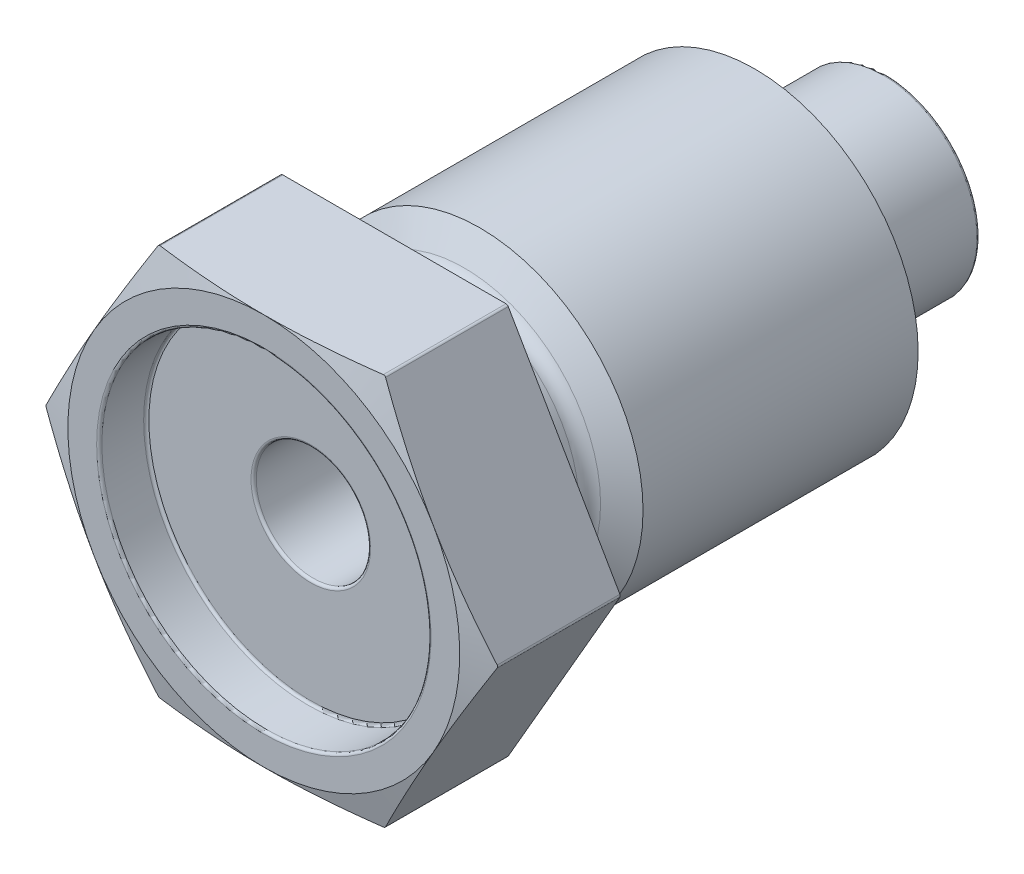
ISO-10303-21;
HEADER;
FILE_DESCRIPTION(('STEP AP214'),'2;1');
FILE_NAME('part.step','',(''),(''),'','','');
FILE_SCHEMA(('AUTOMOTIVE_DESIGN { 1 0 10303 214 1 1 1 1 }'));
ENDSEC;
DATA;
#1=APPLICATION_CONTEXT('core data for automotive mechanical design processes');
#2=APPLICATION_PROTOCOL_DEFINITION('international standard','automotive_design',2000,#1);
#3=PRODUCT_CONTEXT('',#1,'mechanical');
#4=PRODUCT('Part','Part','',(#3));
#5=PRODUCT_RELATED_PRODUCT_CATEGORY('part','',(#4));
#6=PRODUCT_DEFINITION_FORMATION('','',#4);
#7=PRODUCT_DEFINITION_CONTEXT('part definition',#1,'design');
#8=PRODUCT_DEFINITION('design','',#6,#7);
#9=PRODUCT_DEFINITION_SHAPE('','',#8);
#10=(LENGTH_UNIT() NAMED_UNIT(*) SI_UNIT(.MILLI.,.METRE.));
#11=(NAMED_UNIT(*) PLANE_ANGLE_UNIT() SI_UNIT($,.RADIAN.));
#12=(NAMED_UNIT(*) SI_UNIT($,.STERADIAN.) SOLID_ANGLE_UNIT());
#13=UNCERTAINTY_MEASURE_WITH_UNIT(LENGTH_MEASURE(1.E-05),#10,'distance_accuracy_value','');
#14=(GEOMETRIC_REPRESENTATION_CONTEXT(3) GLOBAL_UNCERTAINTY_ASSIGNED_CONTEXT((#13)) GLOBAL_UNIT_ASSIGNED_CONTEXT((#10,
#11,#12)) REPRESENTATION_CONTEXT('',''));
#15=CARTESIAN_POINT('',(0.,0.,0.));
#16=DIRECTION('',(0.,0.,1.));
#17=DIRECTION('',(1.,0.,0.));
#18=AXIS2_PLACEMENT_3D('',#15,#16,#17);
#19=CARTESIAN_POINT('',(0.,0.,-30.226));
#20=DIRECTION('',(0.,0.,1.));
#21=DIRECTION('',(1.,0.,0.));
#22=AXIS2_PLACEMENT_3D('',#19,#20,#21);
#23=CYLINDRICAL_SURFACE('',#22,2.7813);
#24=CARTESIAN_POINT('',(0.,0.,-30.099));
#25=DIRECTION('',(0.,0.,-1.));
#26=DIRECTION('',(-1.,0.,0.));
#27=AXIS2_PLACEMENT_3D('',#24,#25,#26);
#28=CIRCLE('',#27,2.7813);
#29=CARTESIAN_POINT('',(-2.7813,0.,-30.099));
#30=VERTEX_POINT('',#29);
#31=EDGE_CURVE('E380',#30,#30,#28,.T.);
#32=ORIENTED_EDGE('',*,*,#31,.T.);
#33=EDGE_LOOP('',(#32));
#34=FACE_BOUND('',#33,.T.);
#35=CARTESIAN_POINT('',(0.,0.,-2.413));
#36=DIRECTION('',(0.,0.,1.));
#37=DIRECTION('',(1.,0.,0.));
#38=AXIS2_PLACEMENT_3D('',#35,#36,#37);
#39=CIRCLE('',#38,2.7813);
#40=CARTESIAN_POINT('',(2.7813,0.,-2.413));
#41=VERTEX_POINT('',#40);
#42=EDGE_CURVE('E382',#41,#41,#39,.T.);
#43=ORIENTED_EDGE('',*,*,#42,.T.);
#44=EDGE_LOOP('',(#43));
#45=FACE_BOUND('',#44,.T.);
#46=ADVANCED_FACE('F31',(#34,#45),#23,.F.);
#47=CARTESIAN_POINT('',(10.9985226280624,0.,-6.35));
#48=DIRECTION('',(0.866025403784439,0.5,0.));
#49=DIRECTION('',(-0.5,0.866025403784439,0.));
#50=AXIS2_PLACEMENT_3D('',#47,#48,#49);
#51=PLANE('',#50);
#52=CARTESIAN_POINT('',(5.49914584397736,9.5252,-0.394860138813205));
#53=CARTESIAN_POINT('',(5.7275259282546,9.12963409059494,-0.333640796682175));
#54=CARTESIAN_POINT('',(5.95632008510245,8.73335098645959,-0.27806378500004));
#55=CARTESIAN_POINT('',(6.41471638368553,7.93938530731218,-0.180420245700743));
#56=CARTESIAN_POINT('',(6.64431881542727,7.54170222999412,-0.138359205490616));
#57=CARTESIAN_POINT('',(7.10293961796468,6.74734769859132,-0.0702030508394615));
#58=CARTESIAN_POINT('',(7.33195488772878,6.3506816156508,-0.0440266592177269));
#59=CARTESIAN_POINT('',(7.79027747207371,5.5568436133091,-0.00892680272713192));
#60=CARTESIAN_POINT('',(8.01958472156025,5.15967180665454,0.));
#61=CARTESIAN_POINT('',(8.47819922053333,4.36532819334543,0.));
#62=CARTESIAN_POINT('',(8.70750647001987,3.96815638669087,-0.0089268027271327));
#63=CARTESIAN_POINT('',(9.1658290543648,3.17431838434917,-0.0440266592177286));
#64=CARTESIAN_POINT('',(9.39484432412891,2.77765230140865,-0.0702030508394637));
#65=CARTESIAN_POINT('',(9.85346512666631,1.98329777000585,-0.13835920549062));
#66=CARTESIAN_POINT('',(10.0830675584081,1.58561469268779,-0.180420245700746));
#67=CARTESIAN_POINT('',(10.5414638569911,0.79164901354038,-0.278063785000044));
#68=CARTESIAN_POINT('',(10.770258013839,0.395365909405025,-0.33364079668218));
#69=CARTESIAN_POINT('',(10.9986380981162,-0.000200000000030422,-0.39486013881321));
#70=B_SPLINE_CURVE_WITH_KNOTS('',3,(#52,#53,#54,#55,#56,#57,#58,#59,#60,#61,#62,#63,#64,#65,#66,
#67,#68,#69),.UNSPECIFIED.,.F.,.F.,(4,2,2,2,2,2,2,2,4),(0.,1.38260595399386,2.76577253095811,
4.14180081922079,5.51756281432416,6.89332480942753,8.26935309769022,9.65251967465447,
11.0351256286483),.UNSPECIFIED.);
#71=CARTESIAN_POINT('',(8.24889197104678,4.7625,0.));
#72=VERTEX_POINT('',#71);
#73=CARTESIAN_POINT('',(10.9618608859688,0.0634999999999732,-0.385054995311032));
#74=VERTEX_POINT('',#73);
#75=EDGE_CURVE('E145',#72,#74,#70,.T.);
#76=ORIENTED_EDGE('',*,*,#75,.T.);
#77=DIRECTION('',(0.,0.,1.));
#78=VECTOR('',#77,1.);
#79=CARTESIAN_POINT('',(10.9618608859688,0.0634999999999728,-6.35));
#80=LINE('',#79,#78);
#81=CARTESIAN_POINT('',(10.9618608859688,0.0634999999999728,-6.35));
#82=VERTEX_POINT('',#81);
#83=EDGE_CURVE('E323',#74,#82,#80,.F.);
#84=ORIENTED_EDGE('',*,*,#83,.T.);
#85=DIRECTION('',(-0.5,0.866025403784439,0.));
#86=VECTOR('',#85,1.);
#87=CARTESIAN_POINT('',(10.9985226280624,0.,-6.35));
#88=LINE('',#87,#86);
#89=CARTESIAN_POINT('',(5.53592305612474,9.4615,-6.35));
#90=VERTEX_POINT('',#89);
#91=EDGE_CURVE('E483',#82,#90,#88,.T.);
#92=ORIENTED_EDGE('',*,*,#91,.T.);
#93=DIRECTION('',(0.,0.,1.));
#94=VECTOR('',#93,1.);
#95=CARTESIAN_POINT('',(5.53592305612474,9.4615,-6.35));
#96=LINE('',#95,#94);
#97=CARTESIAN_POINT('',(5.53592305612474,9.4615,-0.385054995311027));
#98=VERTEX_POINT('',#97);
#99=EDGE_CURVE('E149',#90,#98,#96,.T.);
#100=ORIENTED_EDGE('',*,*,#99,.T.);
#101=EDGE_CURVE('E141',#98,#72,#70,.T.);
#102=ORIENTED_EDGE('',*,*,#101,.T.);
#103=EDGE_LOOP('',(#76,#84,#92,#100,#102));
#104=FACE_BOUND('',#103,.T.);
#105=ADVANCED_FACE('F143',(#104),#51,.T.);
#106=CARTESIAN_POINT('',(5.4992613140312,9.525,-6.35));
#107=DIRECTION('',(0.,1.,0.));
#108=DIRECTION('',(0.,0.,1.));
#109=AXIS2_PLACEMENT_3D('',#106,#107,#108);
#110=PLANE('',#109);
#111=DIRECTION('',(-1.,0.,0.));
#112=VECTOR('',#111,1.);
#113=CARTESIAN_POINT('',(5.4992613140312,9.525,-6.35));
#114=LINE('',#113,#112);
#115=CARTESIAN_POINT('',(5.42593782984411,9.525,-6.35));
#116=VERTEX_POINT('',#115);
#117=CARTESIAN_POINT('',(-5.4259378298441,9.525,-6.35));
#118=VERTEX_POINT('',#117);
#119=EDGE_CURVE('E466',#116,#118,#114,.T.);
#120=ORIENTED_EDGE('',*,*,#119,.T.);
#121=DIRECTION('',(0.,0.,1.));
#122=VECTOR('',#121,1.);
#123=CARTESIAN_POINT('',(-5.4259378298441,9.525,-6.35));
#124=LINE('',#123,#122);
#125=CARTESIAN_POINT('',(-5.4259378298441,9.525,-0.385054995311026));
#126=VERTEX_POINT('',#125);
#127=EDGE_CURVE('E327',#118,#126,#124,.T.);
#128=ORIENTED_EDGE('',*,*,#127,.T.);
#129=CARTESIAN_POINT('',(-14.6175685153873,9.525,-2.12270214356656));
#130=CARTESIAN_POINT('',(-14.1846363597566,9.525,-2.02553708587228));
#131=CARTESIAN_POINT('',(-13.751435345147,9.525,-1.92954871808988));
#132=CARTESIAN_POINT('',(-12.8843634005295,9.525,-1.7405606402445));
#133=CARTESIAN_POINT('',(-12.450492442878,9.525,-1.64756105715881));
#134=CARTESIAN_POINT('',(-11.5815699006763,9.525,-1.46510699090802));
#135=CARTESIAN_POINT('',(-11.1465175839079,9.525,-1.37565598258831));
#136=CARTESIAN_POINT('',(-10.275512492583,9.525,-1.20125338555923));
#137=CARTESIAN_POINT('',(-9.83955972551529,9.525,-1.11630175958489));
#138=CARTESIAN_POINT('',(-8.9700820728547,9.525,-0.952627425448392));
#139=CARTESIAN_POINT('',(-8.53656556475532,9.525,-0.873860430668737));
#140=CARTESIAN_POINT('',(-7.66834295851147,9.525,-0.723124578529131));
#141=CARTESIAN_POINT('',(-7.23363685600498,9.525,-0.651155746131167));
#142=CARTESIAN_POINT('',(-6.36295854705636,9.525,-0.515624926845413));
#143=CARTESIAN_POINT('',(-5.92698649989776,9.525,-0.452061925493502));
#144=CARTESIAN_POINT('',(-5.05365285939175,9.525,-0.335202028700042));
#145=CARTESIAN_POINT('',(-4.61629126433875,9.525,-0.281905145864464));
#146=CARTESIAN_POINT('',(-3.73521331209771,9.525,-0.187071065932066));
#147=CARTESIAN_POINT('',(-3.29148149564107,9.525,-0.145675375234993));
#148=CARTESIAN_POINT('',(-2.40288728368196,9.525,-0.0774902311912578));
#149=CARTESIAN_POINT('',(-1.95802491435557,9.525,-0.0507004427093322));
#150=CARTESIAN_POINT('',(-1.06781744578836,9.525,-0.0132887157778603));
#151=CARTESIAN_POINT('',(-0.622472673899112,9.525,-0.00265914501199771));
#152=CARTESIAN_POINT('',(0.268301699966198,9.525,0.00177704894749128));
#153=CARTESIAN_POINT('',(0.713731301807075,9.525,-0.00441630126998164));
#154=CARTESIAN_POINT('',(1.60568726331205,9.525,-0.0332787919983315));
#155=CARTESIAN_POINT('',(2.05221162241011,9.525,-0.0560085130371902));
#156=CARTESIAN_POINT('',(2.94421955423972,9.525,-0.116640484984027));
#157=CARTESIAN_POINT('',(3.38970310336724,9.525,-0.154543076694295));
#158=CARTESIAN_POINT('',(4.27962466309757,9.525,-0.24358892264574));
#159=CARTESIAN_POINT('',(4.72406177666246,9.525,-0.294741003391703));
#160=CARTESIAN_POINT('',(5.61150281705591,9.525,-0.408135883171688));
#161=CARTESIAN_POINT('',(6.05450673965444,9.525,-0.470378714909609));
#162=CARTESIAN_POINT('',(6.91805602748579,9.525,-0.600761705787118));
#163=CARTESIAN_POINT('',(7.33866579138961,9.525,-0.668479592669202));
#164=CARTESIAN_POINT('',(8.17875258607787,9.525,-0.810642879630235));
#165=CARTESIAN_POINT('',(8.59822958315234,9.525,-0.885088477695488));
#166=CARTESIAN_POINT('',(9.4362168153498,9.525,-1.03945506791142));
#167=CARTESIAN_POINT('',(9.85472694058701,9.525,-1.11937665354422));
#168=CARTESIAN_POINT('',(10.6908659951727,9.525,-1.28366613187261));
#169=CARTESIAN_POINT('',(11.1084949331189,9.525,-1.36803398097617));
#170=CARTESIAN_POINT('',(11.9431118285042,9.525,-1.54042032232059));
#171=CARTESIAN_POINT('',(12.3600995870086,9.525,-1.62843977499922));
#172=CARTESIAN_POINT('',(13.1934351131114,9.525,-1.80746223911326));
#173=CARTESIAN_POINT('',(13.6097828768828,9.525,-1.89846526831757));
#174=CARTESIAN_POINT('',(14.8579523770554,9.525,-2.17512998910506));
#175=CARTESIAN_POINT('',(15.6889606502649,9.525,-2.3644599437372));
#176=CARTESIAN_POINT('',(17.3410597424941,9.525,-2.74796782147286));
#177=CARTESIAN_POINT('',(18.1621663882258,9.525,-2.94207801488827));
#178=CARTESIAN_POINT('',(19.803244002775,9.525,-3.33510260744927));
#179=CARTESIAN_POINT('',(20.623214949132,9.525,-3.53401710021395));
#180=CARTESIAN_POINT('',(22.2612251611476,9.525,-3.93512967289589));
#181=CARTESIAN_POINT('',(23.0792655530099,9.525,-4.13732316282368));
#182=CARTESIAN_POINT('',(24.3058113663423,9.525,-4.44261963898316));
#183=CARTESIAN_POINT('',(24.7145673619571,9.525,-4.54471778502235));
#184=CARTESIAN_POINT('',(25.5319306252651,9.525,-4.74950593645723));
#185=CARTESIAN_POINT('',(25.9405378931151,9.525,-4.8521959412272));
#186=CARTESIAN_POINT('',(26.3490803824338,9.525,-4.95514299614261));
#187=B_SPLINE_CURVE_WITH_KNOTS('',3,(#129,#130,#131,#132,#133,#134,#135,#136,#137,#138,#139,
#140,#141,#142,#143,#144,#145,#146,#147,#148,#149,#150,#151,#152,#153,#154,#155,#156,#157,#158,
#159,#160,#161,#162,#163,#164,#165,#166,#167,#168,#169,#170,#171,#172,#173,#174,#175,#176,#177,
#178,#179,#180,#181,#182,#183,#184,#185,#186),.UNSPECIFIED.,.F.,.F.,(4,2,2,2,2,2,2,2,2,2,2,2,2,
2,2,2,2,2,2,2,2,2,2,2,2,2,2,2,4),(0.,1.33111077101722,2.66227801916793,3.99471812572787,
5.32714719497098,6.64894632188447,7.97075030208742,9.29239461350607,10.6140405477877,
11.950806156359,13.2875410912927,14.6236445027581,15.9597458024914,17.3007666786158,
18.641817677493,19.9837643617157,21.325715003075,22.6037284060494,23.8817794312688,
25.1599691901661,26.4381464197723,27.716661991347,28.9951851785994,31.5520466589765,
34.0832457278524,36.6144941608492,39.1424618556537,40.406403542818,41.6703438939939),.UNSPECIFIED.);
#188=CARTESIAN_POINT('',(0.,9.525,0.));
#189=VERTEX_POINT('',#188);
#190=EDGE_CURVE('E215',#126,#189,#187,.T.);
#191=ORIENTED_EDGE('',*,*,#190,.T.);
#192=CARTESIAN_POINT('',(5.42593782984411,9.525,-0.385054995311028));
#193=VERTEX_POINT('',#192);
#194=EDGE_CURVE('E155',#189,#193,#187,.T.);
#195=ORIENTED_EDGE('',*,*,#194,.T.);
#196=DIRECTION('',(0.,0.,1.));
#197=VECTOR('',#196,1.);
#198=CARTESIAN_POINT('',(5.42593782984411,9.525,-6.35));
#199=LINE('',#198,#197);
#200=EDGE_CURVE('E325',#193,#116,#199,.F.);
#201=ORIENTED_EDGE('',*,*,#200,.T.);
#202=EDGE_LOOP('',(#120,#128,#191,#195,#201));
#203=FACE_BOUND('',#202,.T.);
#204=ADVANCED_FACE('F221',(#203),#110,.T.);
#205=CARTESIAN_POINT('',(-5.49926131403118,9.525,-6.35));
#206=DIRECTION('',(-0.866025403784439,0.5,0.));
#207=DIRECTION('',(-0.5,-0.866025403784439,0.));
#208=AXIS2_PLACEMENT_3D('',#205,#206,#207);
#209=PLANE('',#208);
#210=DIRECTION('',(-0.5,-0.866025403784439,0.));
#211=VECTOR('',#210,1.);
#212=CARTESIAN_POINT('',(-5.49926131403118,9.525,-6.35));
#213=LINE('',#212,#211);
#214=CARTESIAN_POINT('',(-5.53592305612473,9.4615,-6.35));
#215=VERTEX_POINT('',#214);
#216=CARTESIAN_POINT('',(-10.9618608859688,0.0635000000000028,-6.35));
#217=VERTEX_POINT('',#216);
#218=EDGE_CURVE('E426',#215,#217,#213,.T.);
#219=ORIENTED_EDGE('',*,*,#218,.T.);
#220=DIRECTION('',(0.,0.,1.));
#221=VECTOR('',#220,1.);
#222=CARTESIAN_POINT('',(-10.9618608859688,0.0635000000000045,-6.35));
#223=LINE('',#222,#221);
#224=CARTESIAN_POINT('',(-10.9618608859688,0.0635000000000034,-0.385054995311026));
#225=VERTEX_POINT('',#224);
#226=EDGE_CURVE('E268',#217,#225,#223,.T.);
#227=ORIENTED_EDGE('',*,*,#226,.T.);
#228=CARTESIAN_POINT('',(-10.9986380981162,-0.000199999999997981,-0.394860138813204));
#229=CARTESIAN_POINT('',(-10.770258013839,0.395365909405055,-0.333640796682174));
#230=CARTESIAN_POINT('',(-10.5414638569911,0.791649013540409,-0.278063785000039));
#231=CARTESIAN_POINT('',(-10.083067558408,1.58561469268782,-0.180420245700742));
#232=CARTESIAN_POINT('',(-9.8534651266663,1.98329777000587,-0.138359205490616));
#233=CARTESIAN_POINT('',(-9.39484432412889,2.77765230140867,-0.0702030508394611));
#234=CARTESIAN_POINT('',(-9.16582905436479,3.17431838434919,-0.0440266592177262));
#235=CARTESIAN_POINT('',(-8.70750647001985,3.96815638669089,-0.00892680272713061));
#236=CARTESIAN_POINT('',(-8.47819922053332,4.36532819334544,0.));
#237=CARTESIAN_POINT('',(-8.01958472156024,5.15967180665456,0.));
#238=CARTESIAN_POINT('',(-7.7902774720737,5.55684361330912,-0.00892680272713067));
#239=CARTESIAN_POINT('',(-7.33195488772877,6.35068161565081,-0.044026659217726));
#240=CARTESIAN_POINT('',(-7.10293961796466,6.74734769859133,-0.0702030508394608));
#241=CARTESIAN_POINT('',(-6.64431881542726,7.54170222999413,-0.138359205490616));
#242=CARTESIAN_POINT('',(-6.41471638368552,7.93938530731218,-0.180420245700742));
#243=CARTESIAN_POINT('',(-5.95632008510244,8.73335098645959,-0.278063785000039));
#244=CARTESIAN_POINT('',(-5.72752592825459,9.12963409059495,-0.333640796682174));
#245=CARTESIAN_POINT('',(-5.49914584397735,9.5252,-0.394860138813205));
#246=B_SPLINE_CURVE_WITH_KNOTS('',3,(#228,#229,#230,#231,#232,#233,#234,#235,#236,#237,#238,
#239,#240,#241,#242,#243,#244,#245),.UNSPECIFIED.,.F.,.F.,(4,2,2,2,2,2,2,2,4),(0.,
1.38260595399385,2.7657725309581,4.14180081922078,5.51756281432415,6.89332480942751,
8.26935309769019,9.65251967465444,11.0351256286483),.UNSPECIFIED.);
#247=CARTESIAN_POINT('',(-8.24889197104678,4.7625,0.));
#248=VERTEX_POINT('',#247);
#249=EDGE_CURVE('E424',#225,#248,#246,.T.);
#250=ORIENTED_EDGE('',*,*,#249,.T.);
#251=CARTESIAN_POINT('',(-5.53592305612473,9.4615,-0.385054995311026));
#252=VERTEX_POINT('',#251);
#253=EDGE_CURVE('E216',#248,#252,#246,.T.);
#254=ORIENTED_EDGE('',*,*,#253,.T.);
#255=DIRECTION('',(0.,0.,1.));
#256=VECTOR('',#255,1.);
#257=CARTESIAN_POINT('',(-5.53592305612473,9.4615,-6.35));
#258=LINE('',#257,#256);
#259=EDGE_CURVE('E416',#252,#215,#258,.F.);
#260=ORIENTED_EDGE('',*,*,#259,.T.);
#261=EDGE_LOOP('',(#219,#227,#250,#254,#260));
#262=FACE_BOUND('',#261,.T.);
#263=ADVANCED_FACE('F201',(#262),#209,.T.);
#264=CARTESIAN_POINT('',(-10.9985226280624,0.,-6.35));
#265=DIRECTION('',(-0.866025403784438,-0.500000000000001,0.));
#266=DIRECTION('',(0.500000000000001,-0.866025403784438,0.));
#267=AXIS2_PLACEMENT_3D('',#264,#265,#266);
#268=PLANE('',#267);
#269=CARTESIAN_POINT('',(-5.49914584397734,-9.5252,-0.394860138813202));
#270=CARTESIAN_POINT('',(-5.72752592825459,-9.12963409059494,-0.333640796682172));
#271=CARTESIAN_POINT('',(-5.95632008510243,-8.73335098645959,-0.278063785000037));
#272=CARTESIAN_POINT('',(-6.41471638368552,-7.93938530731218,-0.18042024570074));
#273=CARTESIAN_POINT('',(-6.64431881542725,-7.54170222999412,-0.138359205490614));
#274=CARTESIAN_POINT('',(-7.10293961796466,-6.74734769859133,-0.070203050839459));
#275=CARTESIAN_POINT('',(-7.33195488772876,-6.3506816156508,-0.0440266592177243));
#276=CARTESIAN_POINT('',(-7.79027747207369,-5.55684361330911,-0.00892680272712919));
#277=CARTESIAN_POINT('',(-8.01958472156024,-5.15967180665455,0.));
#278=CARTESIAN_POINT('',(-8.47819922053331,-4.36532819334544,0.));
#279=CARTESIAN_POINT('',(-8.70750647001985,-3.96815638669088,-0.00892680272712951));
#280=CARTESIAN_POINT('',(-9.16582905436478,-3.17431838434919,-0.044026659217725));
#281=CARTESIAN_POINT('',(-9.39484432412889,-2.77765230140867,-0.07020305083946));
#282=CARTESIAN_POINT('',(-9.85346512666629,-1.98329777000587,-0.138359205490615));
#283=CARTESIAN_POINT('',(-10.083067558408,-1.58561469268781,-0.180420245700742));
#284=CARTESIAN_POINT('',(-10.5414638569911,-0.791649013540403,-0.278063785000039));
#285=CARTESIAN_POINT('',(-10.770258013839,-0.39536590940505,-0.333640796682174));
#286=CARTESIAN_POINT('',(-10.9986380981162,0.000200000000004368,-0.394860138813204));
#287=B_SPLINE_CURVE_WITH_KNOTS('',3,(#269,#270,#271,#272,#273,#274,#275,#276,#277,#278,#279,
#280,#281,#282,#283,#284,#285,#286),.UNSPECIFIED.,.F.,.F.,(4,2,2,2,2,2,2,2,4),(0.,
1.38260595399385,2.7657725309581,4.14180081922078,5.51756281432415,6.89332480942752,
8.2693530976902,9.65251967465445,11.0351256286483),.UNSPECIFIED.);
#288=CARTESIAN_POINT('',(-8.24889197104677,-4.7625,0.));
#289=VERTEX_POINT('',#288);
#290=CARTESIAN_POINT('',(-10.9618608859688,-0.063499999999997,-0.385054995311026));
#291=VERTEX_POINT('',#290);
#292=EDGE_CURVE('E210',#289,#291,#287,.T.);
#293=ORIENTED_EDGE('',*,*,#292,.T.);
#294=DIRECTION('',(0.,0.,1.));
#295=VECTOR('',#294,1.);
#296=CARTESIAN_POINT('',(-10.9618608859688,-0.0634999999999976,-6.35));
#297=LINE('',#296,#295);
#298=CARTESIAN_POINT('',(-10.9618608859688,-0.0634999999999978,-6.35));
#299=VERTEX_POINT('',#298);
#300=EDGE_CURVE('E272',#291,#299,#297,.F.);
#301=ORIENTED_EDGE('',*,*,#300,.T.);
#302=DIRECTION('',(0.500000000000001,-0.866025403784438,0.));
#303=VECTOR('',#302,1.);
#304=CARTESIAN_POINT('',(-10.9985226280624,0.,-6.35));
#305=LINE('',#304,#303);
#306=CARTESIAN_POINT('',(-5.53592305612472,-9.4615,-6.35));
#307=VERTEX_POINT('',#306);
#308=EDGE_CURVE('E461',#299,#307,#305,.T.);
#309=ORIENTED_EDGE('',*,*,#308,.T.);
#310=DIRECTION('',(0.,0.,1.));
#311=VECTOR('',#310,1.);
#312=CARTESIAN_POINT('',(-5.53592305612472,-9.4615,-6.35));
#313=LINE('',#312,#311);
#314=CARTESIAN_POINT('',(-5.53592305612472,-9.4615,-0.385054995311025));
#315=VERTEX_POINT('',#314);
#316=EDGE_CURVE('E267',#307,#315,#313,.T.);
#317=ORIENTED_EDGE('',*,*,#316,.T.);
#318=EDGE_CURVE('E205',#315,#289,#287,.T.);
#319=ORIENTED_EDGE('',*,*,#318,.T.);
#320=EDGE_LOOP('',(#293,#301,#309,#317,#319));
#321=FACE_BOUND('',#320,.T.);
#322=ADVANCED_FACE('F194',(#321),#268,.T.);
#323=CARTESIAN_POINT('',(-5.49926131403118,-9.525,-6.35));
#324=DIRECTION('',(0.,-1.,0.));
#325=DIRECTION('',(0.,0.,-1.));
#326=AXIS2_PLACEMENT_3D('',#323,#324,#325);
#327=PLANE('',#326);
#328=CARTESIAN_POINT('',(-14.6175685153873,-9.525,-2.12270214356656));
#329=CARTESIAN_POINT('',(-14.1846363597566,-9.525,-2.02553708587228));
#330=CARTESIAN_POINT('',(-13.751435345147,-9.525,-1.92954871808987));
#331=CARTESIAN_POINT('',(-12.8843634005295,-9.525,-1.74056064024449));
#332=CARTESIAN_POINT('',(-12.450492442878,-9.525,-1.64756105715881));
#333=CARTESIAN_POINT('',(-11.5815699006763,-9.525,-1.46510699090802));
#334=CARTESIAN_POINT('',(-11.1465175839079,-9.525,-1.37565598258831));
#335=CARTESIAN_POINT('',(-10.275512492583,-9.525,-1.20125338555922));
#336=CARTESIAN_POINT('',(-9.83955972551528,-9.525,-1.11630175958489));
#337=CARTESIAN_POINT('',(-8.97008207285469,-9.525,-0.952627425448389));
#338=CARTESIAN_POINT('',(-8.53656556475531,-9.525,-0.873860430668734));
#339=CARTESIAN_POINT('',(-7.66834295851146,-9.525,-0.723124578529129));
#340=CARTESIAN_POINT('',(-7.23363685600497,-9.525,-0.651155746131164));
#341=CARTESIAN_POINT('',(-6.36295854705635,-9.525,-0.515624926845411));
#342=CARTESIAN_POINT('',(-5.92698649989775,-9.525,-0.4520619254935));
#343=CARTESIAN_POINT('',(-5.05365285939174,-9.525,-0.33520202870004));
#344=CARTESIAN_POINT('',(-4.61629126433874,-9.525,-0.281905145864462));
#345=CARTESIAN_POINT('',(-3.7352133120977,-9.525,-0.187071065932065));
#346=CARTESIAN_POINT('',(-3.29148149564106,-9.525,-0.145675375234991));
#347=CARTESIAN_POINT('',(-2.40288728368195,-9.525,-0.0774902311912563));
#348=CARTESIAN_POINT('',(-1.95802491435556,-9.525,-0.0507004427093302));
#349=CARTESIAN_POINT('',(-1.06781744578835,-9.525,-0.0132887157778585));
#350=CARTESIAN_POINT('',(-0.622472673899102,-9.525,-0.00265914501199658));
#351=CARTESIAN_POINT('',(0.268301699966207,-9.525,0.001777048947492));
#352=CARTESIAN_POINT('',(0.713731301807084,-9.525,-0.0044163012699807));
#353=CARTESIAN_POINT('',(1.60568726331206,-9.525,-0.0332787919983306));
#354=CARTESIAN_POINT('',(2.05221162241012,-9.525,-0.0560085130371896));
#355=CARTESIAN_POINT('',(2.94421955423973,-9.525,-0.116640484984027));
#356=CARTESIAN_POINT('',(3.38970310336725,-9.525,-0.154543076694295));
#357=CARTESIAN_POINT('',(4.27962466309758,-9.525,-0.24358892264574));
#358=CARTESIAN_POINT('',(4.72406177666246,-9.525,-0.294741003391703));
#359=CARTESIAN_POINT('',(5.61150281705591,-9.525,-0.408135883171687));
#360=CARTESIAN_POINT('',(6.05450673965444,-9.525,-0.470378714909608));
#361=CARTESIAN_POINT('',(6.91805602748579,-9.525,-0.600761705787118));
#362=CARTESIAN_POINT('',(7.33866579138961,-9.525,-0.668479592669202));
#363=CARTESIAN_POINT('',(8.17875258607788,-9.525,-0.810642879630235));
#364=CARTESIAN_POINT('',(8.59822958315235,-9.525,-0.885088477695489));
#365=CARTESIAN_POINT('',(9.4362168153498,-9.525,-1.03945506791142));
#366=CARTESIAN_POINT('',(9.85472694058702,-9.525,-1.11937665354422));
#367=CARTESIAN_POINT('',(10.6908659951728,-9.525,-1.28366613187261));
#368=CARTESIAN_POINT('',(11.1084949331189,-9.525,-1.36803398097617));
#369=CARTESIAN_POINT('',(11.9431118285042,-9.525,-1.54042032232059));
#370=CARTESIAN_POINT('',(12.3600995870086,-9.525,-1.62843977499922));
#371=CARTESIAN_POINT('',(13.1934351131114,-9.525,-1.80746223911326));
#372=CARTESIAN_POINT('',(13.6097828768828,-9.525,-1.89846526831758));
#373=CARTESIAN_POINT('',(14.8579523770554,-9.525,-2.17512998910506));
#374=CARTESIAN_POINT('',(15.6889606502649,-9.525,-2.3644599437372));
#375=CARTESIAN_POINT('',(17.3410597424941,-9.525,-2.74796782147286));
#376=CARTESIAN_POINT('',(18.1621663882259,-9.525,-2.94207801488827));
#377=CARTESIAN_POINT('',(19.8032440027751,-9.525,-3.33510260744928));
#378=CARTESIAN_POINT('',(20.623214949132,-9.525,-3.53401710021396));
#379=CARTESIAN_POINT('',(22.2612251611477,-9.525,-3.93512967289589));
#380=CARTESIAN_POINT('',(23.0792655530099,-9.525,-4.13732316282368));
#381=CARTESIAN_POINT('',(24.3058113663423,-9.525,-4.44261963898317));
#382=CARTESIAN_POINT('',(24.7145673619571,-9.525,-4.54471778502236));
#383=CARTESIAN_POINT('',(25.5319306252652,-9.525,-4.74950593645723));
#384=CARTESIAN_POINT('',(25.9405378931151,-9.525,-4.85219594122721));
#385=CARTESIAN_POINT('',(26.3490803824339,-9.525,-4.95514299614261));
#386=B_SPLINE_CURVE_WITH_KNOTS('',3,(#328,#329,#330,#331,#332,#333,#334,#335,#336,#337,#338,
#339,#340,#341,#342,#343,#344,#345,#346,#347,#348,#349,#350,#351,#352,#353,#354,#355,#356,#357,
#358,#359,#360,#361,#362,#363,#364,#365,#366,#367,#368,#369,#370,#371,#372,#373,#374,#375,#376,
#377,#378,#379,#380,#381,#382,#383,#384,#385),.UNSPECIFIED.,.F.,.F.,(4,2,2,2,2,2,2,2,2,2,2,2,2,
2,2,2,2,2,2,2,2,2,2,2,2,2,2,2,4),(0.,1.33111077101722,2.66227801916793,3.99471812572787,
5.32714719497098,6.64894632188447,7.97075030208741,9.29239461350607,10.6140405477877,
11.950806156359,13.2875410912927,14.6236445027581,15.9597458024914,17.3007666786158,
18.641817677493,19.9837643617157,21.325715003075,22.6037284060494,23.8817794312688,
25.1599691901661,26.4381464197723,27.716661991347,28.9951851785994,31.5520466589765,
34.0832457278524,36.6144941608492,39.1424618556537,40.406403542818,41.670343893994),.UNSPECIFIED.);
#387=CARTESIAN_POINT('',(0.,-9.525,0.));
#388=VERTEX_POINT('',#387);
#389=CARTESIAN_POINT('',(-5.4259378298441,-9.525,-0.385054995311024));
#390=VERTEX_POINT('',#389);
#391=EDGE_CURVE('E150',#388,#390,#386,.F.);
#392=ORIENTED_EDGE('',*,*,#391,.T.);
#393=DIRECTION('',(0.,0.,1.));
#394=VECTOR('',#393,1.);
#395=CARTESIAN_POINT('',(-5.42593782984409,-9.525,-6.35));
#396=LINE('',#395,#394);
#397=CARTESIAN_POINT('',(-5.42593782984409,-9.525,-6.35));
#398=VERTEX_POINT('',#397);
#399=EDGE_CURVE('E294',#390,#398,#396,.F.);
#400=ORIENTED_EDGE('',*,*,#399,.T.);
#401=DIRECTION('',(1.,0.,0.));
#402=VECTOR('',#401,1.);
#403=CARTESIAN_POINT('',(-5.49926131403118,-9.525,-6.35));
#404=LINE('',#403,#402);
#405=CARTESIAN_POINT('',(5.42593782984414,-9.525,-6.35));
#406=VERTEX_POINT('',#405);
#407=EDGE_CURVE('E462',#398,#406,#404,.T.);
#408=ORIENTED_EDGE('',*,*,#407,.T.);
#409=DIRECTION('',(0.,0.,1.));
#410=VECTOR('',#409,1.);
#411=CARTESIAN_POINT('',(5.42593782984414,-9.525,-6.35));
#412=LINE('',#411,#410);
#413=CARTESIAN_POINT('',(5.42593782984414,-9.525,-0.38505499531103));
#414=VERTEX_POINT('',#413);
#415=EDGE_CURVE('E291',#406,#414,#412,.T.);
#416=ORIENTED_EDGE('',*,*,#415,.T.);
#417=EDGE_CURVE('E159',#414,#388,#386,.F.);
#418=ORIENTED_EDGE('',*,*,#417,.T.);
#419=EDGE_LOOP('',(#392,#400,#408,#416,#418));
#420=FACE_BOUND('',#419,.T.);
#421=ADVANCED_FACE('F189',(#420),#327,.T.);
#422=CARTESIAN_POINT('',(5.49926131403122,-9.525,-6.35));
#423=DIRECTION('',(0.866025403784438,-0.5,0.));
#424=DIRECTION('',(0.5,0.866025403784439,0.));
#425=AXIS2_PLACEMENT_3D('',#422,#423,#424);
#426=PLANE('',#425);
#427=CARTESIAN_POINT('',(10.9986380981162,0.000199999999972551,-0.39486013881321));
#428=CARTESIAN_POINT('',(10.770258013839,-0.395365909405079,-0.333640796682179));
#429=CARTESIAN_POINT('',(10.5414638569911,-0.791649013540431,-0.278063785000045));
#430=CARTESIAN_POINT('',(10.0830675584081,-1.58561469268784,-0.180420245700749));
#431=CARTESIAN_POINT('',(9.85346512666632,-1.98329777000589,-0.138359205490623));
#432=CARTESIAN_POINT('',(9.39484432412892,-2.77765230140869,-0.0702030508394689));
#433=CARTESIAN_POINT('',(9.16582905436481,-3.17431838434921,-0.0440266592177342));
#434=CARTESIAN_POINT('',(8.70750647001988,-3.9681563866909,-0.00892680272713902));
#435=CARTESIAN_POINT('',(8.47819922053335,-4.36532819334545,0.));
#436=CARTESIAN_POINT('',(8.01958472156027,-5.15967180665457,0.));
#437=CARTESIAN_POINT('',(7.79027747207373,-5.55684361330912,-0.00892680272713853));
#438=CARTESIAN_POINT('',(7.3319548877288,-6.35068161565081,-0.0440266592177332));
#439=CARTESIAN_POINT('',(7.1029396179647,-6.74734769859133,-0.0702030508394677));
#440=CARTESIAN_POINT('',(6.64431881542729,-7.54170222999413,-0.138359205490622));
#441=CARTESIAN_POINT('',(6.41471638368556,-7.93938530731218,-0.180420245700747));
#442=CARTESIAN_POINT('',(5.95632008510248,-8.73335098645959,-0.278063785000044));
#443=CARTESIAN_POINT('',(5.72752592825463,-9.12963409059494,-0.333640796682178));
#444=CARTESIAN_POINT('',(5.49914584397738,-9.52519999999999,-0.394860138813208));
#445=B_SPLINE_CURVE_WITH_KNOTS('',3,(#427,#428,#429,#430,#431,#432,#433,#434,#435,#436,#437,
#438,#439,#440,#441,#442,#443,#444),.UNSPECIFIED.,.F.,.F.,(4,2,2,2,2,2,2,2,4),(0.,
1.38260595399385,2.76577253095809,4.14180081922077,5.51756281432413,6.89332480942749,
8.26935309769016,9.65251967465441,11.0351256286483),.UNSPECIFIED.);
#446=CARTESIAN_POINT('',(8.2488919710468,-4.76250000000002,0.));
#447=VERTEX_POINT('',#446);
#448=CARTESIAN_POINT('',(5.53592305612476,-9.46149999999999,-0.38505499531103));
#449=VERTEX_POINT('',#448);
#450=EDGE_CURVE('E464',#447,#449,#445,.T.);
#451=ORIENTED_EDGE('',*,*,#450,.T.);
#452=DIRECTION('',(0.,0.,1.));
#453=VECTOR('',#452,1.);
#454=CARTESIAN_POINT('',(5.53592305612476,-9.4615,-6.35));
#455=LINE('',#454,#453);
#456=CARTESIAN_POINT('',(5.53592305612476,-9.4615,-6.35));
#457=VERTEX_POINT('',#456);
#458=EDGE_CURVE('E321',#449,#457,#455,.F.);
#459=ORIENTED_EDGE('',*,*,#458,.T.);
#460=DIRECTION('',(0.5,0.866025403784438,0.));
#461=VECTOR('',#460,1.);
#462=CARTESIAN_POINT('',(5.49926131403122,-9.525,-6.35));
#463=LINE('',#462,#461);
#464=CARTESIAN_POINT('',(10.9618608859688,-0.0635000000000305,-6.35));
#465=VERTEX_POINT('',#464);
#466=EDGE_CURVE('E479',#457,#465,#463,.T.);
#467=ORIENTED_EDGE('',*,*,#466,.T.);
#468=DIRECTION('',(0.,0.,1.));
#469=VECTOR('',#468,1.);
#470=CARTESIAN_POINT('',(10.9618608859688,-0.0635000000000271,-6.35));
#471=LINE('',#470,#469);
#472=CARTESIAN_POINT('',(10.9618608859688,-0.063500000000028,-0.385054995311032));
#473=VERTEX_POINT('',#472);
#474=EDGE_CURVE('E301',#465,#473,#471,.T.);
#475=ORIENTED_EDGE('',*,*,#474,.T.);
#476=EDGE_CURVE('E411',#473,#447,#445,.T.);
#477=ORIENTED_EDGE('',*,*,#476,.T.);
#478=EDGE_LOOP('',(#451,#459,#467,#475,#477));
#479=FACE_BOUND('',#478,.T.);
#480=ADVANCED_FACE('F33',(#479),#426,.T.);
#481=CARTESIAN_POINT('',(0.,0.,-30.226));
#482=DIRECTION('',(0.,0.,1.));
#483=DIRECTION('',(1.,0.,0.));
#484=AXIS2_PLACEMENT_3D('',#481,#482,#483);
#485=CYLINDRICAL_SURFACE('',#484,7.9375);
#486=CARTESIAN_POINT('',(0.,0.,-23.876));
#487=DIRECTION('',(0.,0.,1.));
#488=DIRECTION('',(1.,0.,0.));
#489=AXIS2_PLACEMENT_3D('',#486,#487,#488);
#490=CIRCLE('',#489,7.9375);
#491=CARTESIAN_POINT('',(7.9375,0.,-23.876));
#492=VERTEX_POINT('',#491);
#493=EDGE_CURVE('E484',#492,#492,#490,.T.);
#494=ORIENTED_EDGE('',*,*,#493,.T.);
#495=EDGE_LOOP('',(#494));
#496=FACE_BOUND('',#495,.T.);
#497=CARTESIAN_POINT('',(0.,0.,-10.5009355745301));
#498=DIRECTION('',(0.,0.,1.));
#499=DIRECTION('',(1.,0.,0.));
#500=AXIS2_PLACEMENT_3D('',#497,#498,#499);
#501=CIRCLE('',#500,7.9375);
#502=CARTESIAN_POINT('',(7.9375,0.,-10.5009355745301));
#503=VERTEX_POINT('',#502);
#504=EDGE_CURVE('E435',#503,#503,#501,.T.);
#505=ORIENTED_EDGE('',*,*,#504,.F.);
#506=EDGE_LOOP('',(#505));
#507=FACE_BOUND('',#506,.T.);
#508=ADVANCED_FACE('F510',(#496,#507),#485,.T.);
#509=CARTESIAN_POINT('',(0.,7.9375,-23.876));
#510=DIRECTION('',(0.,0.,-1.));
#511=DIRECTION('',(-1.,0.,0.));
#512=AXIS2_PLACEMENT_3D('',#509,#510,#511);
#513=PLANE('',#512);
#514=CARTESIAN_POINT('',(0.,0.,-23.876));
#515=DIRECTION('',(0.,0.,-1.));
#516=DIRECTION('',(-1.,0.,0.));
#517=AXIS2_PLACEMENT_3D('',#514,#515,#516);
#518=CIRCLE('',#517,5.334);
#519=CARTESIAN_POINT('',(-5.334,0.,-23.876));
#520=VERTEX_POINT('',#519);
#521=EDGE_CURVE('E405',#520,#520,#518,.F.);
#522=ORIENTED_EDGE('',*,*,#521,.T.);
#523=EDGE_LOOP('',(#522));
#524=FACE_BOUND('',#523,.T.);
#525=ORIENTED_EDGE('',*,*,#493,.F.);
#526=EDGE_LOOP('',(#525));
#527=FACE_BOUND('',#526,.T.);
#528=ADVANCED_FACE('F399',(#524,#527),#513,.T.);
#529=CARTESIAN_POINT('',(0.,0.,1.16018937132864));
#530=DIRECTION('',(0.,0.,1.));
#531=DIRECTION('',(1.,0.,0.));
#532=AXIS2_PLACEMENT_3D('',#529,#530,#531);
#533=CYLINDRICAL_SURFACE('',#532,4.572);
#534=CARTESIAN_POINT('',(0.,0.,-30.099));
#535=DIRECTION('',(0.,0.,-1.));
#536=DIRECTION('',(-1.,0.,0.));
#537=AXIS2_PLACEMENT_3D('',#534,#535,#536);
#538=CIRCLE('',#537,4.572);
#539=CARTESIAN_POINT('',(-4.572,0.,-30.099));
#540=VERTEX_POINT('',#539);
#541=EDGE_CURVE('E337',#540,#540,#538,.F.);
#542=ORIENTED_EDGE('',*,*,#541,.T.);
#543=EDGE_LOOP('',(#542));
#544=FACE_BOUND('',#543,.T.);
#545=CARTESIAN_POINT('',(0.,0.,-24.638));
#546=DIRECTION('',(0.,0.,-1.));
#547=DIRECTION('',(-1.,0.,0.));
#548=AXIS2_PLACEMENT_3D('',#545,#546,#547);
#549=CIRCLE('',#548,4.572);
#550=CARTESIAN_POINT('',(-4.572,0.,-24.638));
#551=VERTEX_POINT('',#550);
#552=EDGE_CURVE('E403',#551,#551,#549,.T.);
#553=ORIENTED_EDGE('',*,*,#552,.T.);
#554=EDGE_LOOP('',(#553));
#555=FACE_BOUND('',#554,.T.);
#556=ADVANCED_FACE('F394',(#544,#555),#533,.T.);
#557=CARTESIAN_POINT('',(0.,0.,-30.226));
#558=DIRECTION('',(0.,0.,-1.));
#559=DIRECTION('',(-1.,0.,0.));
#560=AXIS2_PLACEMENT_3D('',#557,#558,#559);
#561=PLANE('',#560);
#562=CARTESIAN_POINT('',(0.,0.,-30.226));
#563=DIRECTION('',(0.,0.,-1.));
#564=DIRECTION('',(-1.,0.,0.));
#565=AXIS2_PLACEMENT_3D('',#562,#563,#564);
#566=CIRCLE('',#565,4.445);
#567=CARTESIAN_POINT('',(-4.445,0.,-30.226));
#568=VERTEX_POINT('',#567);
#569=EDGE_CURVE('E385',#568,#568,#566,.T.);
#570=ORIENTED_EDGE('',*,*,#569,.T.);
#571=EDGE_LOOP('',(#570));
#572=FACE_BOUND('',#571,.T.);
#573=CARTESIAN_POINT('',(0.,0.,-30.226));
#574=DIRECTION('',(0.,0.,-1.));
#575=DIRECTION('',(-1.,0.,0.));
#576=AXIS2_PLACEMENT_3D('',#573,#574,#575);
#577=CIRCLE('',#576,2.9083);
#578=CARTESIAN_POINT('',(-2.9083,0.,-30.226));
#579=VERTEX_POINT('',#578);
#580=EDGE_CURVE('E387',#579,#579,#577,.F.);
#581=ORIENTED_EDGE('',*,*,#580,.T.);
#582=EDGE_LOOP('',(#581));
#583=FACE_BOUND('',#582,.T.);
#584=ADVANCED_FACE('F398',(#572,#583),#561,.T.);
#585=CARTESIAN_POINT('',(0.,0.,1.16018937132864));
#586=DIRECTION('',(0.,0.,1.));
#587=DIRECTION('',(1.,0.,0.));
#588=AXIS2_PLACEMENT_3D('',#585,#586,#587);
#589=CYLINDRICAL_SURFACE('',#588,6.24713);
#590=CARTESIAN_POINT('',(0.,0.,-7.112));
#591=DIRECTION('',(0.,0.,-1.));
#592=DIRECTION('',(-1.,0.,0.));
#593=AXIS2_PLACEMENT_3D('',#590,#591,#592);
#594=CIRCLE('',#593,6.24713);
#595=CARTESIAN_POINT('',(-6.24713,0.,-7.112));
#596=VERTEX_POINT('',#595);
#597=EDGE_CURVE('E408',#596,#596,#594,.T.);
#598=ORIENTED_EDGE('',*,*,#597,.T.);
#599=EDGE_LOOP('',(#598));
#600=FACE_BOUND('',#599,.T.);
#601=CARTESIAN_POINT('',(0.,0.,-9.0850590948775));
#602=DIRECTION('',(0.,0.,1.));
#603=DIRECTION('',(1.,0.,0.));
#604=AXIS2_PLACEMENT_3D('',#601,#602,#603);
#605=CIRCLE('',#604,6.24713);
#606=CARTESIAN_POINT('',(6.24713,0.,-9.0850590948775));
#607=VERTEX_POINT('',#606);
#608=EDGE_CURVE('E535',#607,#607,#605,.T.);
#609=ORIENTED_EDGE('',*,*,#608,.T.);
#610=EDGE_LOOP('',(#609));
#611=FACE_BOUND('',#610,.T.);
#612=ADVANCED_FACE('F516',(#600,#611),#589,.T.);
#613=CARTESIAN_POINT('',(0.,0.,-9.0850590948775));
#614=DIRECTION('',(0.,0.,1.));
#615=DIRECTION('',(1.,0.,0.));
#616=AXIS2_PLACEMENT_3D('',#613,#614,#615);
#617=TOROIDAL_SURFACE('',#616,7.00913,0.762);
#618=CARTESIAN_POINT('',(0.,0.,-9.74497045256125));
#619=DIRECTION('',(0.,0.,1.));
#620=DIRECTION('',(1.,0.,0.));
#621=AXIS2_PLACEMENT_3D('',#618,#619,#620);
#622=CIRCLE('',#621,6.62813);
#623=CARTESIAN_POINT('',(6.62813,0.,-9.74497045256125));
#624=VERTEX_POINT('',#623);
#625=EDGE_CURVE('E437',#624,#624,#622,.T.);
#626=ORIENTED_EDGE('',*,*,#625,.T.);
#627=EDGE_LOOP('',(#626));
#628=FACE_BOUND('',#627,.T.);
#629=ORIENTED_EDGE('',*,*,#608,.F.);
#630=EDGE_LOOP('',(#629));
#631=FACE_BOUND('',#630,.T.);
#632=ADVANCED_FACE('F523',(#628,#631),#617,.F.);
#633=CARTESIAN_POINT('',(0.,0.,-9.74497045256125));
#634=DIRECTION('',(0.,0.,-1.));
#635=DIRECTION('',(-1.,0.,0.));
#636=AXIS2_PLACEMENT_3D('',#633,#634,#635);
#637=CONICAL_SURFACE('',#636,6.62813,1.0471975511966);
#638=ORIENTED_EDGE('',*,*,#504,.T.);
#639=EDGE_LOOP('',(#638));
#640=FACE_BOUND('',#639,.T.);
#641=ORIENTED_EDGE('',*,*,#625,.F.);
#642=EDGE_LOOP('',(#641));
#643=FACE_BOUND('',#642,.T.);
#644=ADVANCED_FACE('F493',(#640,#643),#637,.T.);
#645=CARTESIAN_POINT('',(0.,-19.05,-6.35));
#646=DIRECTION('',(0.,0.,-1.));
#647=DIRECTION('',(-1.,0.,0.));
#648=AXIS2_PLACEMENT_3D('',#645,#646,#647);
#649=PLANE('',#648);
#650=CARTESIAN_POINT('',(0.,0.,-6.35));
#651=DIRECTION('',(0.,0.,-1.));
#652=DIRECTION('',(-1.,0.,0.));
#653=AXIS2_PLACEMENT_3D('',#650,#651,#652);
#654=CIRCLE('',#653,7.00913);
#655=CARTESIAN_POINT('',(-7.00913,0.,-6.35));
#656=VERTEX_POINT('',#655);
#657=EDGE_CURVE('E404',#656,#656,#654,.F.);
#658=ORIENTED_EDGE('',*,*,#657,.T.);
#659=EDGE_LOOP('',(#658));
#660=FACE_BOUND('',#659,.T.);
#661=ORIENTED_EDGE('',*,*,#308,.F.);
#662=CARTESIAN_POINT('',(-10.8518756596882,0.,-6.35));
#663=DIRECTION('',(0.,0.,-1.));
#664=DIRECTION('',(-1.,0.,0.));
#665=AXIS2_PLACEMENT_3D('',#662,#663,#664);
#666=CIRCLE('',#665,0.127);
#667=EDGE_CURVE('E284',#299,#217,#666,.T.);
#668=ORIENTED_EDGE('',*,*,#667,.T.);
#669=ORIENTED_EDGE('',*,*,#218,.F.);
#670=CARTESIAN_POINT('',(-5.4259378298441,9.398,-6.35));
#671=DIRECTION('',(0.,0.,-1.));
#672=DIRECTION('',(-1.,0.,0.));
#673=AXIS2_PLACEMENT_3D('',#670,#671,#672);
#674=CIRCLE('',#673,0.127);
#675=EDGE_CURVE('E276',#215,#118,#674,.T.);
#676=ORIENTED_EDGE('',*,*,#675,.T.);
#677=ORIENTED_EDGE('',*,*,#119,.F.);
#678=CARTESIAN_POINT('',(5.42593782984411,9.398,-6.35));
#679=DIRECTION('',(0.,0.,-1.));
#680=DIRECTION('',(-1.,0.,0.));
#681=AXIS2_PLACEMENT_3D('',#678,#679,#680);
#682=CIRCLE('',#681,0.127);
#683=EDGE_CURVE('E274',#116,#90,#682,.T.);
#684=ORIENTED_EDGE('',*,*,#683,.T.);
#685=ORIENTED_EDGE('',*,*,#91,.F.);
#686=CARTESIAN_POINT('',(10.8518756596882,0.,-6.35));
#687=DIRECTION('',(0.,0.,-1.));
#688=DIRECTION('',(-1.,0.,0.));
#689=AXIS2_PLACEMENT_3D('',#686,#687,#688);
#690=CIRCLE('',#689,0.127);
#691=EDGE_CURVE('E278',#82,#465,#690,.T.);
#692=ORIENTED_EDGE('',*,*,#691,.T.);
#693=ORIENTED_EDGE('',*,*,#466,.F.);
#694=CARTESIAN_POINT('',(5.42593782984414,-9.39799999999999,-6.35));
#695=DIRECTION('',(0.,0.,-1.));
#696=DIRECTION('',(-1.,0.,0.));
#697=AXIS2_PLACEMENT_3D('',#694,#695,#696);
#698=CIRCLE('',#697,0.127);
#699=EDGE_CURVE('E280',#457,#406,#698,.T.);
#700=ORIENTED_EDGE('',*,*,#699,.T.);
#701=ORIENTED_EDGE('',*,*,#407,.F.);
#702=CARTESIAN_POINT('',(-5.42593782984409,-9.39799999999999,-6.35));
#703=DIRECTION('',(0.,0.,-1.));
#704=DIRECTION('',(-1.,0.,0.));
#705=AXIS2_PLACEMENT_3D('',#702,#703,#704);
#706=CIRCLE('',#705,0.127);
#707=EDGE_CURVE('E282',#398,#307,#706,.T.);
#708=ORIENTED_EDGE('',*,*,#707,.T.);
#709=EDGE_LOOP('',(#661,#668,#669,#676,#677,#684,#685,#692,#693,#700,#701,#708));
#710=FACE_BOUND('',#709,.T.);
#711=ADVANCED_FACE('F196',(#660,#710),#649,.T.);
#712=CARTESIAN_POINT('',(0.,0.,0.));
#713=DIRECTION('',(0.,0.,-1.));
#714=DIRECTION('',(-1.,0.,0.));
#715=AXIS2_PLACEMENT_3D('',#712,#713,#714);
#716=CONICAL_SURFACE('',#715,9.525,1.30899693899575);
#717=ORIENTED_EDGE('',*,*,#417,.F.);
#718=CARTESIAN_POINT('',(5.42593782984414,-9.525,-0.38505499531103));
#719=CARTESIAN_POINT('',(5.43284477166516,-9.52500670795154,-0.385972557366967));
#720=CARTESIAN_POINT('',(5.43976957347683,-9.52443684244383,-0.386759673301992));
#721=CARTESIAN_POINT('',(5.45345504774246,-9.52217493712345,-0.388054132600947));
#722=CARTESIAN_POINT('',(5.46021583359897,-9.52048369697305,-0.388561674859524));
#723=CARTESIAN_POINT('',(5.47338956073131,-9.51600798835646,-0.389279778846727));
#724=CARTESIAN_POINT('',(5.47980219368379,-9.51322256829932,-0.38949008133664));
#725=CARTESIAN_POINT('',(5.49208686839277,-9.50663627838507,-0.389606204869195));
#726=CARTESIAN_POINT('',(5.49795885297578,-9.50283530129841,-0.389511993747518));
#727=CARTESIAN_POINT('',(5.50894806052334,-9.49436438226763,-0.389024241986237));
#728=CARTESIAN_POINT('',(5.51407091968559,-9.48970159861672,-0.388633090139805));
#729=CARTESIAN_POINT('',(5.52347179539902,-9.47962971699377,-0.387567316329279));
#730=CARTESIAN_POINT('',(5.52775118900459,-9.47422186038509,-0.3868931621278));
#731=CARTESIAN_POINT('',(5.5330904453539,-9.46622777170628,-0.385765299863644));
#732=CARTESIAN_POINT('',(5.53454704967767,-9.46388463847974,-0.385420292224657));
#733=CARTESIAN_POINT('',(5.53592305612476,-9.4615,-0.38505499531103));
#734=B_SPLINE_CURVE_WITH_KNOTS('',3,(#718,#719,#720,#721,#722,#723,#724,#725,#726,#727,#728,
#729,#730,#731,#732,#733),.UNSPECIFIED.,.F.,.F.,(4,2,2,2,2,2,2,4),(0.,0.0208791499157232,
0.0417434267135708,0.0626258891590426,0.0835105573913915,0.104228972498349,0.124913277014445,
0.133247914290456),.UNSPECIFIED.);
#735=EDGE_CURVE('E296',#414,#449,#734,.T.);
#736=ORIENTED_EDGE('',*,*,#735,.T.);
#737=ORIENTED_EDGE('',*,*,#450,.F.);
#738=CARTESIAN_POINT('',(0.,0.,0.));
#739=DIRECTION('',(0.,0.,1.));
#740=DIRECTION('',(1.,0.,0.));
#741=AXIS2_PLACEMENT_3D('',#738,#739,#740);
#742=CIRCLE('',#741,9.525);
#743=EDGE_CURVE('E173',#388,#447,#742,.T.);
#744=ORIENTED_EDGE('',*,*,#743,.F.);
#745=EDGE_LOOP('',(#717,#736,#737,#744));
#746=FACE_BOUND('',#745,.T.);
#747=ADVANCED_FACE('F185',(#746),#716,.T.);
#748=ORIENTED_EDGE('',*,*,#476,.F.);
#749=CARTESIAN_POINT('',(10.9618608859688,-0.0635000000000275,-0.385054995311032));
#750=CARTESIAN_POINT('',(10.9653201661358,-0.0575217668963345,-0.385972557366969));
#751=CARTESIAN_POINT('',(10.9682890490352,-0.0512397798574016,-0.386759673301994));
#752=CARTESIAN_POINT('',(10.9731729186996,-0.0382568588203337,-0.388054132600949));
#753=CARTESIAN_POINT('',(10.9750886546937,-0.0315562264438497,-0.388561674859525));
#754=CARTESIAN_POINT('',(10.977799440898,-0.0179095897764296,-0.389279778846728));
#755=CARTESIAN_POINT('',(10.9785935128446,-0.0109633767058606,-0.389490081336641));
#756=CARTESIAN_POINT('',(10.9790319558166,0.00296860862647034,-0.389606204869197));
#757=CARTESIAN_POINT('',(10.9786762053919,0.00995438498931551,-0.38951199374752));
#758=CARTESIAN_POINT('',(10.9768347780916,0.0237067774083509,-0.389024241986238));
#759=CARTESIAN_POINT('',(10.9753581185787,0.0304746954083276,-0.388633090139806));
#760=CARTESIAN_POINT('',(10.971336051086,0.0436520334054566,-0.38756731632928));
#761=CARTESIAN_POINT('',(10.9687924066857,0.0500620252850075,-0.386893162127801));
#762=CARTESIAN_POINT('',(10.9645389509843,0.0586830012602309,-0.385765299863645));
#763=CARTESIAN_POINT('',(10.9632380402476,0.0611160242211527,-0.385420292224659));
#764=CARTESIAN_POINT('',(10.9618608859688,0.0634999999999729,-0.385054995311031));
#765=B_SPLINE_CURVE_WITH_KNOTS('',3,(#749,#750,#751,#752,#753,#754,#755,#756,#757,#758,#759,
#760,#761,#762,#763,#764),.UNSPECIFIED.,.F.,.F.,(4,2,2,2,2,2,2,4),(0.,0.0208791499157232,
0.0417434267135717,0.0626258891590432,0.0835105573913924,0.104228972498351,0.124913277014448,
0.133247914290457),.UNSPECIFIED.);
#766=EDGE_CURVE('E168',#473,#74,#765,.T.);
#767=ORIENTED_EDGE('',*,*,#766,.T.);
#768=ORIENTED_EDGE('',*,*,#75,.F.);
#769=EDGE_CURVE('E162',#447,#72,#742,.T.);
#770=ORIENTED_EDGE('',*,*,#769,.F.);
#771=EDGE_LOOP('',(#748,#767,#768,#770));
#772=FACE_BOUND('',#771,.T.);
#773=ADVANCED_FACE('F166',(#772),#716,.T.);
#774=ORIENTED_EDGE('',*,*,#318,.F.);
#775=CARTESIAN_POINT('',(-5.53592305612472,-9.4615,-0.385054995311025));
#776=CARTESIAN_POINT('',(-5.53247539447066,-9.46748494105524,-0.385972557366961));
#777=CARTESIAN_POINT('',(-5.5285194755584,-9.47319706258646,-0.386759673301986));
#778=CARTESIAN_POINT('',(-5.51971787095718,-9.48391807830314,-0.388054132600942));
#779=CARTESIAN_POINT('',(-5.51487282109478,-9.48892747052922,-0.388561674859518));
#780=CARTESIAN_POINT('',(-5.50440988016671,-9.49809839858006,-0.389279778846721));
#781=CARTESIAN_POINT('',(-5.49879131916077,-9.50225919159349,-0.389490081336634));
#782=CARTESIAN_POINT('',(-5.48694508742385,-9.50960488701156,-0.389606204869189));
#783=CARTESIAN_POINT('',(-5.4807173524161,-9.51278968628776,-0.389511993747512));
#784=CARTESIAN_POINT('',(-5.46788671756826,-9.51807115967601,-0.389024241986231));
#785=CARTESIAN_POINT('',(-5.46128719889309,-9.52017629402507,-0.388633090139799));
#786=CARTESIAN_POINT('',(-5.44786425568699,-9.52328175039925,-0.387567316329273));
#787=CARTESIAN_POINT('',(-5.44104121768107,-9.52428388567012,-0.386893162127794));
#788=CARTESIAN_POINT('',(-5.43144850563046,-9.52491077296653,-0.385765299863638));
#789=CARTESIAN_POINT('',(-5.42869099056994,-9.52500066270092,-0.385420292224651));
#790=CARTESIAN_POINT('',(-5.42593782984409,-9.525,-0.385054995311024));
#791=B_SPLINE_CURVE_WITH_KNOTS('',3,(#775,#776,#777,#778,#779,#780,#781,#782,#783,#784,#785,
#786,#787,#788,#789,#790),.UNSPECIFIED.,.F.,.F.,(4,2,2,2,2,2,2,4),(0.,0.0208791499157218,
0.0417434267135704,0.0626258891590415,0.0835105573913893,0.104228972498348,0.124913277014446,
0.133247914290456),.UNSPECIFIED.);
#792=EDGE_CURVE('E286',#315,#390,#791,.T.);
#793=ORIENTED_EDGE('',*,*,#792,.T.);
#794=ORIENTED_EDGE('',*,*,#391,.F.);
#795=EDGE_CURVE('E174',#289,#388,#742,.T.);
#796=ORIENTED_EDGE('',*,*,#795,.F.);
#797=EDGE_LOOP('',(#774,#793,#794,#796));
#798=FACE_BOUND('',#797,.T.);
#799=ADVANCED_FACE('F449',(#798),#716,.T.);
#800=ORIENTED_EDGE('',*,*,#249,.F.);
#801=CARTESIAN_POINT('',(-10.9618608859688,0.0635000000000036,-0.385054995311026));
#802=CARTESIAN_POINT('',(-10.9653201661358,0.0575217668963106,-0.385972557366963));
#803=CARTESIAN_POINT('',(-10.9682890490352,0.0512397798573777,-0.386759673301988));
#804=CARTESIAN_POINT('',(-10.9731729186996,0.0382568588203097,-0.388054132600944));
#805=CARTESIAN_POINT('',(-10.9750886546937,0.0315562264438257,-0.388561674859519));
#806=CARTESIAN_POINT('',(-10.977799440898,0.0179095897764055,-0.389279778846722));
#807=CARTESIAN_POINT('',(-10.9785935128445,0.0109633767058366,-0.389490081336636));
#808=CARTESIAN_POINT('',(-10.9790319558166,-0.00296860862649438,-0.389606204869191));
#809=CARTESIAN_POINT('',(-10.9786762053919,-0.00995438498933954,-0.389511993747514));
#810=CARTESIAN_POINT('',(-10.9768347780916,-0.0237067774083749,-0.389024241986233));
#811=CARTESIAN_POINT('',(-10.9753581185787,-0.0304746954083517,-0.388633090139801));
#812=CARTESIAN_POINT('',(-10.971336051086,-0.0436520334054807,-0.387567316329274));
#813=CARTESIAN_POINT('',(-10.9687924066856,-0.0500620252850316,-0.386893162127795));
#814=CARTESIAN_POINT('',(-10.9645389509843,-0.0586830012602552,-0.38576529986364));
#815=CARTESIAN_POINT('',(-10.9632380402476,-0.0611160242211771,-0.385420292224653));
#816=CARTESIAN_POINT('',(-10.9618608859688,-0.0634999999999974,-0.385054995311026));
#817=B_SPLINE_CURVE_WITH_KNOTS('',3,(#801,#802,#803,#804,#805,#806,#807,#808,#809,#810,#811,
#812,#813,#814,#815,#816),.UNSPECIFIED.,.F.,.F.,(4,2,2,2,2,2,2,4),(0.,0.0208791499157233,
0.0417434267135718,0.0626258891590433,0.0835105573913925,0.104228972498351,0.124913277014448,
0.133247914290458),.UNSPECIFIED.);
#818=EDGE_CURVE('E261',#225,#291,#817,.T.);
#819=ORIENTED_EDGE('',*,*,#818,.T.);
#820=ORIENTED_EDGE('',*,*,#292,.F.);
#821=EDGE_CURVE('E433',#248,#289,#742,.T.);
#822=ORIENTED_EDGE('',*,*,#821,.F.);
#823=EDGE_LOOP('',(#800,#819,#820,#822));
#824=FACE_BOUND('',#823,.T.);
#825=ADVANCED_FACE('F429',(#824),#716,.T.);
#826=ORIENTED_EDGE('',*,*,#190,.F.);
#827=CARTESIAN_POINT('',(-5.4259378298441,9.525,-0.385054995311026));
#828=CARTESIAN_POINT('',(-5.43284477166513,9.52500670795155,-0.385972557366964));
#829=CARTESIAN_POINT('',(-5.4397695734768,9.52443684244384,-0.386759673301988));
#830=CARTESIAN_POINT('',(-5.45345504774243,9.52217493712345,-0.388054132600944));
#831=CARTESIAN_POINT('',(-5.46021583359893,9.52048369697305,-0.388561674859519));
#832=CARTESIAN_POINT('',(-5.47338956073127,9.51600798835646,-0.389279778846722));
#833=CARTESIAN_POINT('',(-5.47980219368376,9.51322256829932,-0.389490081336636));
#834=CARTESIAN_POINT('',(-5.49208686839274,9.50663627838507,-0.389606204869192));
#835=CARTESIAN_POINT('',(-5.49795885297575,9.50283530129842,-0.389511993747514));
#836=CARTESIAN_POINT('',(-5.50894806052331,9.49436438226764,-0.389024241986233));
#837=CARTESIAN_POINT('',(-5.51407091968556,9.48970159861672,-0.388633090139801));
#838=CARTESIAN_POINT('',(-5.52347179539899,9.47962971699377,-0.387567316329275));
#839=CARTESIAN_POINT('',(-5.52775118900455,9.47422186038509,-0.386893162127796));
#840=CARTESIAN_POINT('',(-5.53309044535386,9.46622777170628,-0.38576529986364));
#841=CARTESIAN_POINT('',(-5.53454704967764,9.46388463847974,-0.385420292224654));
#842=CARTESIAN_POINT('',(-5.53592305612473,9.4615,-0.385054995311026));
#843=B_SPLINE_CURVE_WITH_KNOTS('',3,(#827,#828,#829,#830,#831,#832,#833,#834,#835,#836,#837,
#838,#839,#840,#841,#842),.UNSPECIFIED.,.F.,.F.,(4,2,2,2,2,2,2,4),(0.,0.0208791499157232,
0.0417434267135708,0.0626258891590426,0.0835105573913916,0.104228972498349,0.124913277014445,
0.133247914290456),.UNSPECIFIED.);
#844=EDGE_CURVE('E55',#126,#252,#843,.T.);
#845=ORIENTED_EDGE('',*,*,#844,.T.);
#846=ORIENTED_EDGE('',*,*,#253,.F.);
#847=EDGE_CURVE('E160',#189,#248,#742,.T.);
#848=ORIENTED_EDGE('',*,*,#847,.F.);
#849=EDGE_LOOP('',(#826,#845,#846,#848));
#850=FACE_BOUND('',#849,.T.);
#851=ADVANCED_FACE('F444',(#850),#716,.T.);
#852=ORIENTED_EDGE('',*,*,#101,.F.);
#853=CARTESIAN_POINT('',(5.53592305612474,9.4615,-0.385054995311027));
#854=CARTESIAN_POINT('',(5.53247539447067,9.46748494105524,-0.385972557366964));
#855=CARTESIAN_POINT('',(5.52851947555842,9.47319706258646,-0.386759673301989));
#856=CARTESIAN_POINT('',(5.5197178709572,9.48391807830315,-0.388054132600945));
#857=CARTESIAN_POINT('',(5.51487282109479,9.48892747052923,-0.388561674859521));
#858=CARTESIAN_POINT('',(5.50440988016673,9.49809839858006,-0.389279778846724));
#859=CARTESIAN_POINT('',(5.49879131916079,9.50225919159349,-0.389490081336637));
#860=CARTESIAN_POINT('',(5.48694508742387,9.50960488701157,-0.389606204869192));
#861=CARTESIAN_POINT('',(5.48071735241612,9.51278968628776,-0.389511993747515));
#862=CARTESIAN_POINT('',(5.46788671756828,9.51807115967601,-0.389024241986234));
#863=CARTESIAN_POINT('',(5.46128719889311,9.52017629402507,-0.388633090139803));
#864=CARTESIAN_POINT('',(5.44786425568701,9.52328175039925,-0.387567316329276));
#865=CARTESIAN_POINT('',(5.44104121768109,9.52428388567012,-0.386893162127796));
#866=CARTESIAN_POINT('',(5.43144850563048,9.52491077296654,-0.385765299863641));
#867=CARTESIAN_POINT('',(5.42869099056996,9.52500066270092,-0.385420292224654));
#868=CARTESIAN_POINT('',(5.42593782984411,9.525,-0.385054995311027));
#869=B_SPLINE_CURVE_WITH_KNOTS('',3,(#853,#854,#855,#856,#857,#858,#859,#860,#861,#862,#863,
#864,#865,#866,#867,#868),.UNSPECIFIED.,.F.,.F.,(4,2,2,2,2,2,2,4),(0.,0.0208791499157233,
0.0417434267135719,0.0626258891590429,0.083510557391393,0.104228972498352,0.124913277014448,
0.133247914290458),.UNSPECIFIED.);
#870=EDGE_CURVE('E47',#98,#193,#869,.T.);
#871=ORIENTED_EDGE('',*,*,#870,.T.);
#872=ORIENTED_EDGE('',*,*,#194,.F.);
#873=EDGE_CURVE('E153',#72,#189,#742,.T.);
#874=ORIENTED_EDGE('',*,*,#873,.F.);
#875=EDGE_LOOP('',(#852,#871,#872,#874));
#876=FACE_BOUND('',#875,.T.);
#877=ADVANCED_FACE('F154',(#876),#716,.T.);
#878=CARTESIAN_POINT('',(0.,-19.05,0.));
#879=DIRECTION('',(0.,0.,-1.));
#880=DIRECTION('',(-1.,0.,0.));
#881=AXIS2_PLACEMENT_3D('',#878,#879,#880);
#882=PLANE('',#881);
#883=CARTESIAN_POINT('',(0.,0.,0.));
#884=DIRECTION('',(0.,0.,-1.));
#885=DIRECTION('',(-1.,0.,0.));
#886=AXIS2_PLACEMENT_3D('',#883,#884,#885);
#887=CIRCLE('',#886,8.128);
#888=CARTESIAN_POINT('',(-8.128,0.,0.));
#889=VERTEX_POINT('',#888);
#890=EDGE_CURVE('E11',#889,#889,#887,.T.);
#891=ORIENTED_EDGE('',*,*,#890,.T.);
#892=EDGE_LOOP('',(#891));
#893=FACE_BOUND('',#892,.T.);
#894=ORIENTED_EDGE('',*,*,#847,.T.);
#895=ORIENTED_EDGE('',*,*,#821,.T.);
#896=ORIENTED_EDGE('',*,*,#795,.T.);
#897=ORIENTED_EDGE('',*,*,#743,.T.);
#898=ORIENTED_EDGE('',*,*,#769,.T.);
#899=ORIENTED_EDGE('',*,*,#873,.T.);
#900=EDGE_LOOP('',(#894,#895,#896,#897,#898,#899));
#901=FACE_BOUND('',#900,.T.);
#902=ADVANCED_FACE('F170',(#893,#901),#882,.F.);
#903=CARTESIAN_POINT('',(0.,0.,-2.286));
#904=DIRECTION('',(0.,0.,1.));
#905=DIRECTION('',(1.,0.,0.));
#906=AXIS2_PLACEMENT_3D('',#903,#904,#905);
#907=PLANE('',#906);
#908=CARTESIAN_POINT('',(0.,0.,-2.286));
#909=DIRECTION('',(0.,0.,1.));
#910=DIRECTION('',(1.,0.,0.));
#911=AXIS2_PLACEMENT_3D('',#908,#909,#910);
#912=CIRCLE('',#911,2.9083);
#913=CARTESIAN_POINT('',(2.9083,0.,-2.286));
#914=VERTEX_POINT('',#913);
#915=EDGE_CURVE('E371',#914,#914,#912,.F.);
#916=ORIENTED_EDGE('',*,*,#915,.T.);
#917=EDGE_LOOP('',(#916));
#918=FACE_BOUND('',#917,.T.);
#919=CARTESIAN_POINT('',(0.,0.,-2.286));
#920=DIRECTION('',(0.,0.,1.));
#921=DIRECTION('',(1.,0.,0.));
#922=AXIS2_PLACEMENT_3D('',#919,#920,#921);
#923=CIRCLE('',#922,7.874);
#924=CARTESIAN_POINT('',(7.874,0.,-2.286));
#925=VERTEX_POINT('',#924);
#926=EDGE_CURVE('E375',#925,#925,#923,.T.);
#927=ORIENTED_EDGE('',*,*,#926,.T.);
#928=EDGE_LOOP('',(#927));
#929=FACE_BOUND('',#928,.T.);
#930=ADVANCED_FACE('F240',(#918,#929),#907,.T.);
#931=CARTESIAN_POINT('',(0.,0.,-2.286));
#932=DIRECTION('',(0.,0.,1.));
#933=DIRECTION('',(1.,0.,0.));
#934=AXIS2_PLACEMENT_3D('',#931,#932,#933);
#935=CYLINDRICAL_SURFACE('',#934,8.001);
#936=CARTESIAN_POINT('',(0.,0.,-2.159));
#937=DIRECTION('',(0.,0.,1.));
#938=DIRECTION('',(1.,0.,0.));
#939=AXIS2_PLACEMENT_3D('',#936,#937,#938);
#940=CIRCLE('',#939,8.001);
#941=CARTESIAN_POINT('',(8.001,0.,-2.159));
#942=VERTEX_POINT('',#941);
#943=EDGE_CURVE('E40',#942,#942,#940,.F.);
#944=ORIENTED_EDGE('',*,*,#943,.T.);
#945=EDGE_LOOP('',(#944));
#946=FACE_BOUND('',#945,.T.);
#947=CARTESIAN_POINT('',(0.,0.,-0.127));
#948=DIRECTION('',(0.,0.,-1.));
#949=DIRECTION('',(-1.,0.,0.));
#950=AXIS2_PLACEMENT_3D('',#947,#948,#949);
#951=CIRCLE('',#950,8.001);
#952=CARTESIAN_POINT('',(-8.001,0.,-0.127));
#953=VERTEX_POINT('',#952);
#954=EDGE_CURVE('E369',#953,#953,#951,.F.);
#955=ORIENTED_EDGE('',*,*,#954,.T.);
#956=EDGE_LOOP('',(#955));
#957=FACE_BOUND('',#956,.T.);
#958=ADVANCED_FACE('F236',(#946,#957),#935,.F.);
#959=CARTESIAN_POINT('',(0.,0.,-24.638));
#960=DIRECTION('',(0.,0.,-1.));
#961=DIRECTION('',(-1.,0.,0.));
#962=AXIS2_PLACEMENT_3D('',#959,#960,#961);
#963=TOROIDAL_SURFACE('',#962,5.334,0.762);
#964=ORIENTED_EDGE('',*,*,#552,.F.);
#965=EDGE_LOOP('',(#964));
#966=FACE_BOUND('',#965,.T.);
#967=ORIENTED_EDGE('',*,*,#521,.F.);
#968=EDGE_LOOP('',(#967));
#969=FACE_BOUND('',#968,.T.);
#970=ADVANCED_FACE('F239',(#966,#969),#963,.F.);
#971=CARTESIAN_POINT('',(0.,0.,-7.112));
#972=DIRECTION('',(0.,0.,-1.));
#973=DIRECTION('',(-1.,0.,0.));
#974=AXIS2_PLACEMENT_3D('',#971,#972,#973);
#975=TOROIDAL_SURFACE('',#974,7.00913,0.762);
#976=ORIENTED_EDGE('',*,*,#597,.F.);
#977=EDGE_LOOP('',(#976));
#978=FACE_BOUND('',#977,.T.);
#979=ORIENTED_EDGE('',*,*,#657,.F.);
#980=EDGE_LOOP('',(#979));
#981=FACE_BOUND('',#980,.T.);
#982=ADVANCED_FACE('F247',(#978,#981),#975,.F.);
#983=CARTESIAN_POINT('',(-10.8518756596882,0.,-6.35));
#984=DIRECTION('',(0.,0.,1.));
#985=DIRECTION('',(1.,0.,0.));
#986=AXIS2_PLACEMENT_3D('',#983,#984,#985);
#987=CYLINDRICAL_SURFACE('',#986,0.127);
#988=ORIENTED_EDGE('',*,*,#667,.F.);
#989=ORIENTED_EDGE('',*,*,#300,.F.);
#990=ORIENTED_EDGE('',*,*,#818,.F.);
#991=ORIENTED_EDGE('',*,*,#226,.F.);
#992=EDGE_LOOP('',(#988,#989,#990,#991));
#993=FACE_BOUND('',#992,.T.);
#994=ADVANCED_FACE('F251',(#993),#987,.T.);
#995=CARTESIAN_POINT('',(-5.42593782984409,-9.39799999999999,-6.35));
#996=DIRECTION('',(0.,0.,1.));
#997=DIRECTION('',(1.,0.,0.));
#998=AXIS2_PLACEMENT_3D('',#995,#996,#997);
#999=CYLINDRICAL_SURFACE('',#998,0.127);
#1000=ORIENTED_EDGE('',*,*,#707,.F.);
#1001=ORIENTED_EDGE('',*,*,#399,.F.);
#1002=ORIENTED_EDGE('',*,*,#792,.F.);
#1003=ORIENTED_EDGE('',*,*,#316,.F.);
#1004=EDGE_LOOP('',(#1000,#1001,#1002,#1003));
#1005=FACE_BOUND('',#1004,.T.);
#1006=ADVANCED_FACE('F256',(#1005),#999,.T.);
#1007=CARTESIAN_POINT('',(5.42593782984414,-9.39799999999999,-6.35));
#1008=DIRECTION('',(0.,0.,1.));
#1009=DIRECTION('',(1.,0.,0.));
#1010=AXIS2_PLACEMENT_3D('',#1007,#1008,#1009);
#1011=CYLINDRICAL_SURFACE('',#1010,0.127);
#1012=ORIENTED_EDGE('',*,*,#699,.F.);
#1013=ORIENTED_EDGE('',*,*,#458,.F.);
#1014=ORIENTED_EDGE('',*,*,#735,.F.);
#1015=ORIENTED_EDGE('',*,*,#415,.F.);
#1016=EDGE_LOOP('',(#1012,#1013,#1014,#1015));
#1017=FACE_BOUND('',#1016,.T.);
#1018=ADVANCED_FACE('F303',(#1017),#1011,.T.);
#1019=CARTESIAN_POINT('',(10.8518756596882,0.,-6.35));
#1020=DIRECTION('',(0.,0.,1.));
#1021=DIRECTION('',(1.,0.,0.));
#1022=AXIS2_PLACEMENT_3D('',#1019,#1020,#1021);
#1023=CYLINDRICAL_SURFACE('',#1022,0.127);
#1024=ORIENTED_EDGE('',*,*,#691,.F.);
#1025=ORIENTED_EDGE('',*,*,#83,.F.);
#1026=ORIENTED_EDGE('',*,*,#766,.F.);
#1027=ORIENTED_EDGE('',*,*,#474,.F.);
#1028=EDGE_LOOP('',(#1024,#1025,#1026,#1027));
#1029=FACE_BOUND('',#1028,.T.);
#1030=ADVANCED_FACE('F307',(#1029),#1023,.T.);
#1031=CARTESIAN_POINT('',(-5.4259378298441,9.398,-6.35));
#1032=DIRECTION('',(0.,0.,1.));
#1033=DIRECTION('',(1.,0.,0.));
#1034=AXIS2_PLACEMENT_3D('',#1031,#1032,#1033);
#1035=CYLINDRICAL_SURFACE('',#1034,0.127);
#1036=ORIENTED_EDGE('',*,*,#675,.F.);
#1037=ORIENTED_EDGE('',*,*,#259,.F.);
#1038=ORIENTED_EDGE('',*,*,#844,.F.);
#1039=ORIENTED_EDGE('',*,*,#127,.F.);
#1040=EDGE_LOOP('',(#1036,#1037,#1038,#1039));
#1041=FACE_BOUND('',#1040,.T.);
#1042=ADVANCED_FACE('F312',(#1041),#1035,.T.);
#1043=CARTESIAN_POINT('',(5.42593782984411,9.398,-6.35));
#1044=DIRECTION('',(0.,0.,1.));
#1045=DIRECTION('',(1.,0.,0.));
#1046=AXIS2_PLACEMENT_3D('',#1043,#1044,#1045);
#1047=CYLINDRICAL_SURFACE('',#1046,0.127);
#1048=ORIENTED_EDGE('',*,*,#683,.F.);
#1049=ORIENTED_EDGE('',*,*,#200,.F.);
#1050=ORIENTED_EDGE('',*,*,#870,.F.);
#1051=ORIENTED_EDGE('',*,*,#99,.F.);
#1052=EDGE_LOOP('',(#1048,#1049,#1050,#1051));
#1053=FACE_BOUND('',#1052,.T.);
#1054=ADVANCED_FACE('F339',(#1053),#1047,.T.);
#1055=CARTESIAN_POINT('',(0.,0.,-30.099));
#1056=DIRECTION('',(0.,0.,-1.));
#1057=DIRECTION('',(-1.,0.,0.));
#1058=AXIS2_PLACEMENT_3D('',#1055,#1056,#1057);
#1059=TOROIDAL_SURFACE('',#1058,4.445,0.127);
#1060=ORIENTED_EDGE('',*,*,#569,.F.);
#1061=EDGE_LOOP('',(#1060));
#1062=FACE_BOUND('',#1061,.T.);
#1063=ORIENTED_EDGE('',*,*,#541,.F.);
#1064=EDGE_LOOP('',(#1063));
#1065=FACE_BOUND('',#1064,.T.);
#1066=ADVANCED_FACE('F343',(#1062,#1065),#1059,.T.);
#1067=CARTESIAN_POINT('',(0.,0.,-30.099));
#1068=DIRECTION('',(0.,0.,-1.));
#1069=DIRECTION('',(-1.,0.,0.));
#1070=AXIS2_PLACEMENT_3D('',#1067,#1068,#1069);
#1071=TOROIDAL_SURFACE('',#1070,2.9083,0.127);
#1072=ORIENTED_EDGE('',*,*,#31,.F.);
#1073=EDGE_LOOP('',(#1072));
#1074=FACE_BOUND('',#1073,.T.);
#1075=ORIENTED_EDGE('',*,*,#580,.F.);
#1076=EDGE_LOOP('',(#1075));
#1077=FACE_BOUND('',#1076,.T.);
#1078=ADVANCED_FACE('F347',(#1074,#1077),#1071,.T.);
#1079=CARTESIAN_POINT('',(0.,0.,-2.413));
#1080=DIRECTION('',(0.,0.,1.));
#1081=DIRECTION('',(1.,0.,0.));
#1082=AXIS2_PLACEMENT_3D('',#1079,#1080,#1081);
#1083=TOROIDAL_SURFACE('',#1082,2.9083,0.127);
#1084=ORIENTED_EDGE('',*,*,#42,.F.);
#1085=EDGE_LOOP('',(#1084));
#1086=FACE_BOUND('',#1085,.T.);
#1087=ORIENTED_EDGE('',*,*,#915,.F.);
#1088=EDGE_LOOP('',(#1087));
#1089=FACE_BOUND('',#1088,.T.);
#1090=ADVANCED_FACE('F351',(#1086,#1089),#1083,.T.);
#1091=CARTESIAN_POINT('',(0.,0.,-2.159));
#1092=DIRECTION('',(0.,0.,1.));
#1093=DIRECTION('',(1.,0.,0.));
#1094=AXIS2_PLACEMENT_3D('',#1091,#1092,#1093);
#1095=TOROIDAL_SURFACE('',#1094,7.874,0.127);
#1096=ORIENTED_EDGE('',*,*,#943,.F.);
#1097=EDGE_LOOP('',(#1096));
#1098=FACE_BOUND('',#1097,.T.);
#1099=ORIENTED_EDGE('',*,*,#926,.F.);
#1100=EDGE_LOOP('',(#1099));
#1101=FACE_BOUND('',#1100,.T.);
#1102=ADVANCED_FACE('F355',(#1098,#1101),#1095,.F.);
#1103=CARTESIAN_POINT('',(0.,0.,-0.127));
#1104=DIRECTION('',(0.,0.,-1.));
#1105=DIRECTION('',(-1.,0.,0.));
#1106=AXIS2_PLACEMENT_3D('',#1103,#1104,#1105);
#1107=TOROIDAL_SURFACE('',#1106,8.128,0.127);
#1108=ORIENTED_EDGE('',*,*,#890,.F.);
#1109=EDGE_LOOP('',(#1108));
#1110=FACE_BOUND('',#1109,.T.);
#1111=ORIENTED_EDGE('',*,*,#954,.F.);
#1112=EDGE_LOOP('',(#1111));
#1113=FACE_BOUND('',#1112,.T.);
#1114=ADVANCED_FACE('F359',(#1110,#1113),#1107,.T.);
#1115=CLOSED_SHELL('',(#46,#105,#204,#263,#322,#421,#480,#508,#528,#556,#584,#612,#632,#644,
#711,#747,#773,#799,#825,#851,#877,#902,#930,#958,#970,#982,#994,#1006,#1018,#1030,#1042,#1054,
#1066,#1078,#1090,#1102,#1114));
#1116=MANIFOLD_SOLID_BREP('B2',#1115);
#1117=ADVANCED_BREP_SHAPE_REPRESENTATION('',(#18,#1116),#14);
#1118=SHAPE_DEFINITION_REPRESENTATION(#9,#1117);
ENDSEC;
END-ISO-10303-21;
